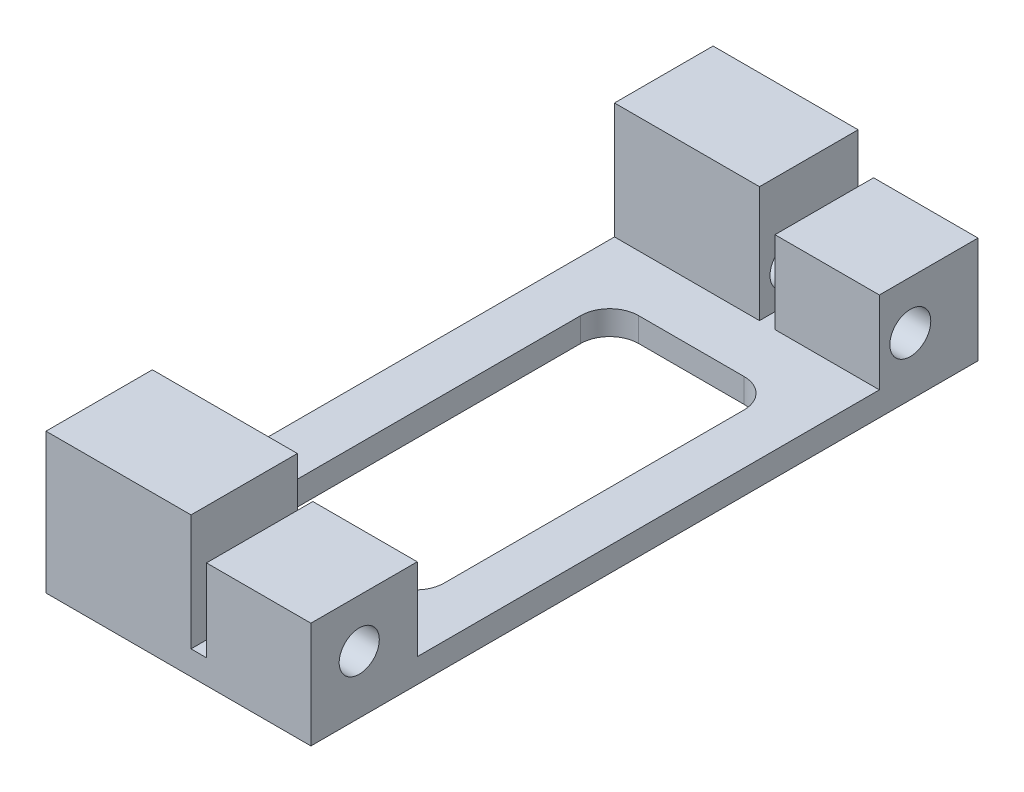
ISO-10303-21;
HEADER;
FILE_DESCRIPTION(('STEP AP214'),'2;1');
FILE_NAME('part.step','',(''),(''),'','','');
FILE_SCHEMA(('AUTOMOTIVE_DESIGN { 1 0 10303 214 1 1 1 1 }'));
ENDSEC;
DATA;
#1=APPLICATION_CONTEXT('core data for automotive mechanical design processes');
#2=APPLICATION_PROTOCOL_DEFINITION('international standard','automotive_design',2000,#1);
#3=PRODUCT_CONTEXT('',#1,'mechanical');
#4=PRODUCT('Part','Part','',(#3));
#5=PRODUCT_RELATED_PRODUCT_CATEGORY('part','',(#4));
#6=PRODUCT_DEFINITION_FORMATION('','',#4);
#7=PRODUCT_DEFINITION_CONTEXT('part definition',#1,'design');
#8=PRODUCT_DEFINITION('design','',#6,#7);
#9=PRODUCT_DEFINITION_SHAPE('','',#8);
#10=(LENGTH_UNIT() NAMED_UNIT(*) SI_UNIT(.MILLI.,.METRE.));
#11=(NAMED_UNIT(*) PLANE_ANGLE_UNIT() SI_UNIT($,.RADIAN.));
#12=(NAMED_UNIT(*) SI_UNIT($,.STERADIAN.) SOLID_ANGLE_UNIT());
#13=UNCERTAINTY_MEASURE_WITH_UNIT(LENGTH_MEASURE(1.E-05),#10,'distance_accuracy_value','');
#14=(GEOMETRIC_REPRESENTATION_CONTEXT(3) GLOBAL_UNCERTAINTY_ASSIGNED_CONTEXT((#13)) GLOBAL_UNIT_ASSIGNED_CONTEXT((#10,
#11,#12)) REPRESENTATION_CONTEXT('',''));
#15=CARTESIAN_POINT('',(0.,0.,0.));
#16=DIRECTION('',(0.,0.,1.));
#17=DIRECTION('',(1.,0.,0.));
#18=AXIS2_PLACEMENT_3D('',#15,#16,#17);
#19=CARTESIAN_POINT('',(0.,0.,0.));
#20=DIRECTION('',(0.,-1.,0.));
#21=DIRECTION('',(0.,0.,-1.));
#22=AXIS2_PLACEMENT_3D('',#19,#20,#21);
#23=PLANE('',#22);
#24=DIRECTION('',(0.,0.,1.));
#25=VECTOR('',#24,1.);
#26=CARTESIAN_POINT('',(-2.19999999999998,0.,-16.5));
#27=LINE('',#26,#25);
#28=CARTESIAN_POINT('',(-2.19999999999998,0.,-16.5));
#29=VERTEX_POINT('',#28);
#30=CARTESIAN_POINT('',(-2.19999999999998,0.,14.5));
#31=VERTEX_POINT('',#30);
#32=EDGE_CURVE('E331',#29,#31,#27,.T.);
#33=ORIENTED_EDGE('',*,*,#32,.F.);
#34=CARTESIAN_POINT('',(0.800000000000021,0.,-16.5));
#35=DIRECTION('',(0.,1.,0.));
#36=DIRECTION('',(0.,0.,1.));
#37=AXIS2_PLACEMENT_3D('',#34,#35,#36);
#38=CIRCLE('',#37,3.);
#39=CARTESIAN_POINT('',(0.800000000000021,0.,-19.5));
#40=VERTEX_POINT('',#39);
#41=EDGE_CURVE('E303',#40,#29,#38,.T.);
#42=ORIENTED_EDGE('',*,*,#41,.F.);
#43=DIRECTION('',(-1.,0.,0.));
#44=VECTOR('',#43,1.);
#45=CARTESIAN_POINT('',(0.800000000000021,0.,-19.5));
#46=LINE('',#45,#44);
#47=CARTESIAN_POINT('',(11.7,0.,-19.5));
#48=VERTEX_POINT('',#47);
#49=EDGE_CURVE('E308',#48,#40,#46,.T.);
#50=ORIENTED_EDGE('',*,*,#49,.F.);
#51=CARTESIAN_POINT('',(11.7,0.,-16.5));
#52=DIRECTION('',(0.,1.,0.));
#53=DIRECTION('',(0.,0.,-1.));
#54=AXIS2_PLACEMENT_3D('',#51,#52,#53);
#55=CIRCLE('',#54,3.);
#56=CARTESIAN_POINT('',(14.7,0.,-16.5));
#57=VERTEX_POINT('',#56);
#58=EDGE_CURVE('E346',#57,#48,#55,.T.);
#59=ORIENTED_EDGE('',*,*,#58,.F.);
#60=DIRECTION('',(0.,0.,-1.));
#61=VECTOR('',#60,1.);
#62=CARTESIAN_POINT('',(14.7,0.,-16.5));
#63=LINE('',#62,#61);
#64=CARTESIAN_POINT('',(14.7,0.,14.5));
#65=VERTEX_POINT('',#64);
#66=EDGE_CURVE('E343',#65,#57,#63,.T.);
#67=ORIENTED_EDGE('',*,*,#66,.F.);
#68=CARTESIAN_POINT('',(11.7,0.,14.5));
#69=DIRECTION('',(0.,1.,0.));
#70=DIRECTION('',(0.,0.,1.));
#71=AXIS2_PLACEMENT_3D('',#68,#69,#70);
#72=CIRCLE('',#71,3.);
#73=CARTESIAN_POINT('',(11.7,0.,17.5));
#74=VERTEX_POINT('',#73);
#75=EDGE_CURVE('E340',#74,#65,#72,.T.);
#76=ORIENTED_EDGE('',*,*,#75,.F.);
#77=DIRECTION('',(1.,0.,0.));
#78=VECTOR('',#77,1.);
#79=CARTESIAN_POINT('',(0.800000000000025,0.,17.5));
#80=LINE('',#79,#78);
#81=CARTESIAN_POINT('',(0.800000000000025,0.,17.5));
#82=VERTEX_POINT('',#81);
#83=EDGE_CURVE('E337',#82,#74,#80,.T.);
#84=ORIENTED_EDGE('',*,*,#83,.F.);
#85=CARTESIAN_POINT('',(0.800000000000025,0.,14.5));
#86=DIRECTION('',(0.,1.,0.));
#87=DIRECTION('',(0.,0.,1.));
#88=AXIS2_PLACEMENT_3D('',#85,#86,#87);
#89=CIRCLE('',#88,3.);
#90=EDGE_CURVE('E334',#31,#82,#89,.T.);
#91=ORIENTED_EDGE('',*,*,#90,.F.);
#92=EDGE_LOOP('',(#33,#42,#50,#59,#67,#76,#84,#91));
#93=FACE_BOUND('',#92,.T.);
#94=DIRECTION('',(-1.,0.,0.));
#95=VECTOR('',#94,1.);
#96=CARTESIAN_POINT('',(19.9,0.,22.5));
#97=LINE('',#96,#95);
#98=CARTESIAN_POINT('',(19.9,0.,22.5));
#99=VERTEX_POINT('',#98);
#100=CARTESIAN_POINT('',(9.10000000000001,0.,22.5));
#101=VERTEX_POINT('',#100);
#102=EDGE_CURVE('E59',#99,#101,#97,.T.);
#103=ORIENTED_EDGE('',*,*,#102,.F.);
#104=DIRECTION('',(0.,0.,-1.));
#105=VECTOR('',#104,1.);
#106=CARTESIAN_POINT('',(19.9,0.,-35.5));
#107=LINE('',#106,#105);
#108=CARTESIAN_POINT('',(19.9,0.,-25.3));
#109=VERTEX_POINT('',#108);
#110=EDGE_CURVE('E385',#99,#109,#107,.T.);
#111=ORIENTED_EDGE('',*,*,#110,.T.);
#112=DIRECTION('',(1.,0.,0.));
#113=VECTOR('',#112,1.);
#114=CARTESIAN_POINT('',(9.1,0.,-25.3));
#115=LINE('',#114,#113);
#116=CARTESIAN_POINT('',(9.1,0.,-25.3));
#117=VERTEX_POINT('',#116);
#118=EDGE_CURVE('E222',#117,#109,#115,.T.);
#119=ORIENTED_EDGE('',*,*,#118,.F.);
#120=DIRECTION('',(0.,0.,1.));
#121=VECTOR('',#120,1.);
#122=CARTESIAN_POINT('',(9.1,0.,-35.5));
#123=LINE('',#122,#121);
#124=CARTESIAN_POINT('',(9.1,0.,-35.5));
#125=VERTEX_POINT('',#124);
#126=EDGE_CURVE('E219',#125,#117,#123,.T.);
#127=ORIENTED_EDGE('',*,*,#126,.F.);
#128=DIRECTION('',(-1.,0.,0.));
#129=VECTOR('',#128,1.);
#130=CARTESIAN_POINT('',(19.9,0.,-35.5));
#131=LINE('',#130,#129);
#132=CARTESIAN_POINT('',(7.5,0.,-35.5));
#133=VERTEX_POINT('',#132);
#134=EDGE_CURVE('E372',#125,#133,#131,.T.);
#135=ORIENTED_EDGE('',*,*,#134,.T.);
#136=DIRECTION('',(0.,0.,-1.));
#137=VECTOR('',#136,1.);
#138=CARTESIAN_POINT('',(7.5,0.,-35.5));
#139=LINE('',#138,#137);
#140=CARTESIAN_POINT('',(7.5,0.,-25.3));
#141=VERTEX_POINT('',#140);
#142=EDGE_CURVE('E276',#141,#133,#139,.T.);
#143=ORIENTED_EDGE('',*,*,#142,.F.);
#144=DIRECTION('',(1.,0.,0.));
#145=VECTOR('',#144,1.);
#146=CARTESIAN_POINT('',(-7.5,0.,-25.3));
#147=LINE('',#146,#145);
#148=CARTESIAN_POINT('',(-7.5,0.,-25.3));
#149=VERTEX_POINT('',#148);
#150=EDGE_CURVE('E273',#149,#141,#147,.T.);
#151=ORIENTED_EDGE('',*,*,#150,.F.);
#152=DIRECTION('',(0.,0.,1.));
#153=VECTOR('',#152,1.);
#154=CARTESIAN_POINT('',(-7.5,0.,-35.5));
#155=LINE('',#154,#153);
#156=CARTESIAN_POINT('',(-7.49999999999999,0.,22.5));
#157=VERTEX_POINT('',#156);
#158=EDGE_CURVE('E353',#149,#157,#155,.T.);
#159=ORIENTED_EDGE('',*,*,#158,.T.);
#160=DIRECTION('',(-1.,0.,0.));
#161=VECTOR('',#160,1.);
#162=CARTESIAN_POINT('',(-7.5,0.,22.5));
#163=LINE('',#162,#161);
#164=CARTESIAN_POINT('',(7.5,0.,22.5));
#165=VERTEX_POINT('',#164);
#166=EDGE_CURVE('E291',#165,#157,#163,.T.);
#167=ORIENTED_EDGE('',*,*,#166,.F.);
#168=DIRECTION('',(0.,0.,-1.));
#169=VECTOR('',#168,1.);
#170=CARTESIAN_POINT('',(7.5,0.,22.5));
#171=LINE('',#170,#169);
#172=CARTESIAN_POINT('',(7.5,0.,33.5));
#173=VERTEX_POINT('',#172);
#174=EDGE_CURVE('E288',#173,#165,#171,.T.);
#175=ORIENTED_EDGE('',*,*,#174,.F.);
#176=DIRECTION('',(1.,0.,0.));
#177=VECTOR('',#176,1.);
#178=CARTESIAN_POINT('',(19.9,0.,33.5));
#179=LINE('',#178,#177);
#180=CARTESIAN_POINT('',(9.10000000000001,0.,33.5));
#181=VERTEX_POINT('',#180);
#182=EDGE_CURVE('E383',#173,#181,#179,.T.);
#183=ORIENTED_EDGE('',*,*,#182,.T.);
#184=DIRECTION('',(0.,0.,1.));
#185=VECTOR('',#184,1.);
#186=CARTESIAN_POINT('',(9.10000000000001,0.,22.5));
#187=LINE('',#186,#185);
#188=EDGE_CURVE('E54',#101,#181,#187,.T.);
#189=ORIENTED_EDGE('',*,*,#188,.F.);
#190=EDGE_LOOP('',(#103,#111,#119,#127,#135,#143,#151,#159,#167,#175,#183,#189));
#191=FACE_BOUND('',#190,.T.);
#192=ADVANCED_FACE('F37',(#93,#191),#23,.F.);
#193=CARTESIAN_POINT('',(-7.5,-2.5,-35.5));
#194=DIRECTION('',(-1.,0.,0.));
#195=DIRECTION('',(0.,0.,1.));
#196=AXIS2_PLACEMENT_3D('',#193,#194,#195);
#197=PLANE('',#196);
#198=CARTESIAN_POINT('',(-7.49999999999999,3.5,28.5));
#199=DIRECTION('',(-1.,0.,0.));
#200=DIRECTION('',(0.,0.,1.));
#201=AXIS2_PLACEMENT_3D('',#198,#199,#200);
#202=CIRCLE('',#201,2.07435792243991);
#203=CARTESIAN_POINT('',(-7.49999999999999,3.5,30.5743579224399));
#204=VERTEX_POINT('',#203);
#205=EDGE_CURVE('E398',#204,#204,#202,.T.);
#206=ORIENTED_EDGE('',*,*,#205,.F.);
#207=EDGE_LOOP('',(#206));
#208=FACE_BOUND('',#207,.T.);
#209=CARTESIAN_POINT('',(-7.5,3.5,-28.5));
#210=DIRECTION('',(-1.,0.,0.));
#211=DIRECTION('',(0.,0.,1.));
#212=AXIS2_PLACEMENT_3D('',#209,#210,#211);
#213=CIRCLE('',#212,2.11605772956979);
#214=CARTESIAN_POINT('',(-7.5,3.5,-26.3839422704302));
#215=VERTEX_POINT('',#214);
#216=EDGE_CURVE('E413',#215,#215,#213,.T.);
#217=ORIENTED_EDGE('',*,*,#216,.F.);
#218=EDGE_LOOP('',(#217));
#219=FACE_BOUND('',#218,.T.);
#220=DIRECTION('',(0.,0.,1.));
#221=VECTOR('',#220,1.);
#222=CARTESIAN_POINT('',(-7.5,12.,-35.5));
#223=LINE('',#222,#221);
#224=CARTESIAN_POINT('',(-7.5,12.,-35.5));
#225=VERTEX_POINT('',#224);
#226=CARTESIAN_POINT('',(-7.5,12.,-25.3));
#227=VERTEX_POINT('',#226);
#228=EDGE_CURVE('E249',#225,#227,#223,.T.);
#229=ORIENTED_EDGE('',*,*,#228,.F.);
#230=DIRECTION('',(0.,1.,0.));
#231=VECTOR('',#230,1.);
#232=CARTESIAN_POINT('',(-7.5,-2.5,-35.5));
#233=LINE('',#232,#231);
#234=CARTESIAN_POINT('',(-7.5,-2.5,-35.5));
#235=VERTEX_POINT('',#234);
#236=EDGE_CURVE('E11',#235,#225,#233,.T.);
#237=ORIENTED_EDGE('',*,*,#236,.F.);
#238=DIRECTION('',(0.,0.,1.));
#239=VECTOR('',#238,1.);
#240=CARTESIAN_POINT('',(-7.5,-2.5,-35.5));
#241=LINE('',#240,#239);
#242=CARTESIAN_POINT('',(-7.49999999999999,-2.5,33.5));
#243=VERTEX_POINT('',#242);
#244=EDGE_CURVE('E368',#235,#243,#241,.T.);
#245=ORIENTED_EDGE('',*,*,#244,.T.);
#246=DIRECTION('',(0.,1.,0.));
#247=VECTOR('',#246,1.);
#248=CARTESIAN_POINT('',(-7.49999999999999,-2.5,33.5));
#249=LINE('',#248,#247);
#250=CARTESIAN_POINT('',(-7.5,12.,33.5));
#251=VERTEX_POINT('',#250);
#252=EDGE_CURVE('E381',#243,#251,#249,.T.);
#253=ORIENTED_EDGE('',*,*,#252,.T.);
#254=DIRECTION('',(0.,0.,1.));
#255=VECTOR('',#254,1.);
#256=CARTESIAN_POINT('',(-7.5,12.,22.5));
#257=LINE('',#256,#255);
#258=CARTESIAN_POINT('',(-7.5,12.,22.5));
#259=VERTEX_POINT('',#258);
#260=EDGE_CURVE('E261',#259,#251,#257,.T.);
#261=ORIENTED_EDGE('',*,*,#260,.F.);
#262=DIRECTION('',(0.,-1.,0.));
#263=VECTOR('',#262,1.);
#264=CARTESIAN_POINT('',(-7.5,11.,22.5));
#265=LINE('',#264,#263);
#266=EDGE_CURVE('E294',#259,#157,#265,.T.);
#267=ORIENTED_EDGE('',*,*,#266,.T.);
#268=ORIENTED_EDGE('',*,*,#158,.F.);
#269=DIRECTION('',(0.,-1.,0.));
#270=VECTOR('',#269,1.);
#271=CARTESIAN_POINT('',(-7.5,11.,-25.3));
#272=LINE('',#271,#270);
#273=EDGE_CURVE('E285',#227,#149,#272,.T.);
#274=ORIENTED_EDGE('',*,*,#273,.F.);
#275=EDGE_LOOP('',(#229,#237,#245,#253,#261,#267,#268,#274));
#276=FACE_BOUND('',#275,.T.);
#277=ADVANCED_FACE('F39',(#208,#219,#276),#197,.T.);
#278=CARTESIAN_POINT('',(19.9,-2.5,-35.5));
#279=DIRECTION('',(0.,0.,-1.));
#280=DIRECTION('',(-1.,0.,0.));
#281=AXIS2_PLACEMENT_3D('',#278,#279,#280);
#282=PLANE('',#281);
#283=DIRECTION('',(0.,-1.,0.));
#284=VECTOR('',#283,1.);
#285=CARTESIAN_POINT('',(7.5,11.,-35.5));
#286=LINE('',#285,#284);
#287=CARTESIAN_POINT('',(7.5,12.,-35.5));
#288=VERTEX_POINT('',#287);
#289=EDGE_CURVE('E279',#288,#133,#286,.T.);
#290=ORIENTED_EDGE('',*,*,#289,.T.);
#291=ORIENTED_EDGE('',*,*,#134,.F.);
#292=DIRECTION('',(0.,-1.,0.));
#293=VECTOR('',#292,1.);
#294=CARTESIAN_POINT('',(9.1,8.5,-35.5));
#295=LINE('',#294,#293);
#296=CARTESIAN_POINT('',(9.1,8.5,-35.5));
#297=VERTEX_POINT('',#296);
#298=EDGE_CURVE('E246',#297,#125,#295,.T.);
#299=ORIENTED_EDGE('',*,*,#298,.F.);
#300=DIRECTION('',(-1.,0.,0.));
#301=VECTOR('',#300,1.);
#302=CARTESIAN_POINT('',(19.9,8.5,-35.5));
#303=LINE('',#302,#301);
#304=CARTESIAN_POINT('',(19.9,8.5,-35.5));
#305=VERTEX_POINT('',#304);
#306=EDGE_CURVE('E228',#305,#297,#303,.T.);
#307=ORIENTED_EDGE('',*,*,#306,.F.);
#308=DIRECTION('',(0.,1.,0.));
#309=VECTOR('',#308,1.);
#310=CARTESIAN_POINT('',(19.9,-2.5,-35.5));
#311=LINE('',#310,#309);
#312=CARTESIAN_POINT('',(19.9,-2.5,-35.5));
#313=VERTEX_POINT('',#312);
#314=EDGE_CURVE('E46',#313,#305,#311,.T.);
#315=ORIENTED_EDGE('',*,*,#314,.F.);
#316=DIRECTION('',(-1.,0.,0.));
#317=VECTOR('',#316,1.);
#318=CARTESIAN_POINT('',(19.9,-2.5,-35.5));
#319=LINE('',#318,#317);
#320=EDGE_CURVE('E378',#313,#235,#319,.T.);
#321=ORIENTED_EDGE('',*,*,#320,.T.);
#322=ORIENTED_EDGE('',*,*,#236,.T.);
#323=DIRECTION('',(-1.,0.,0.));
#324=VECTOR('',#323,1.);
#325=CARTESIAN_POINT('',(-7.5,12.,-35.5));
#326=LINE('',#325,#324);
#327=EDGE_CURVE('E258',#288,#225,#326,.T.);
#328=ORIENTED_EDGE('',*,*,#327,.F.);
#329=EDGE_LOOP('',(#290,#291,#299,#307,#315,#321,#322,#328));
#330=FACE_BOUND('',#329,.T.);
#331=ADVANCED_FACE('F432',(#330),#282,.T.);
#332=CARTESIAN_POINT('',(19.9,-2.5,-35.5));
#333=DIRECTION('',(1.,0.,0.));
#334=DIRECTION('',(0.,0.,-1.));
#335=AXIS2_PLACEMENT_3D('',#332,#333,#334);
#336=PLANE('',#335);
#337=CARTESIAN_POINT('',(19.9,3.5,28.5));
#338=DIRECTION('',(1.,0.,0.));
#339=DIRECTION('',(0.,0.,-1.));
#340=AXIS2_PLACEMENT_3D('',#337,#338,#339);
#341=CIRCLE('',#340,2.07435792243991);
#342=CARTESIAN_POINT('',(19.9,3.5,26.4256420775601));
#343=VERTEX_POINT('',#342);
#344=EDGE_CURVE('E394',#343,#343,#341,.T.);
#345=ORIENTED_EDGE('',*,*,#344,.F.);
#346=EDGE_LOOP('',(#345));
#347=FACE_BOUND('',#346,.T.);
#348=CARTESIAN_POINT('',(19.9,3.5,-28.5));
#349=DIRECTION('',(1.,0.,0.));
#350=DIRECTION('',(0.,0.,-1.));
#351=AXIS2_PLACEMENT_3D('',#348,#349,#350);
#352=CIRCLE('',#351,2.11605772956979);
#353=CARTESIAN_POINT('',(19.9,3.5,-30.6160577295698));
#354=VERTEX_POINT('',#353);
#355=EDGE_CURVE('E401',#354,#354,#352,.T.);
#356=ORIENTED_EDGE('',*,*,#355,.F.);
#357=EDGE_LOOP('',(#356));
#358=FACE_BOUND('',#357,.T.);
#359=ORIENTED_EDGE('',*,*,#110,.F.);
#360=DIRECTION('',(0.,-1.,0.));
#361=VECTOR('',#360,1.);
#362=CARTESIAN_POINT('',(19.9,8.5,22.5));
#363=LINE('',#362,#361);
#364=CARTESIAN_POINT('',(19.9,8.5,22.5));
#365=VERTEX_POINT('',#364);
#366=EDGE_CURVE('E224',#365,#99,#363,.T.);
#367=ORIENTED_EDGE('',*,*,#366,.F.);
#368=DIRECTION('',(0.,0.,-1.));
#369=VECTOR('',#368,1.);
#370=CARTESIAN_POINT('',(19.9,8.5,33.5));
#371=LINE('',#370,#369);
#372=CARTESIAN_POINT('',(19.9,8.5,33.5));
#373=VERTEX_POINT('',#372);
#374=EDGE_CURVE('E213',#373,#365,#371,.T.);
#375=ORIENTED_EDGE('',*,*,#374,.F.);
#376=DIRECTION('',(0.,1.,0.));
#377=VECTOR('',#376,1.);
#378=CARTESIAN_POINT('',(19.9,-2.5,33.5));
#379=LINE('',#378,#377);
#380=CARTESIAN_POINT('',(19.9,-2.5,33.5));
#381=VERTEX_POINT('',#380);
#382=EDGE_CURVE('E389',#381,#373,#379,.T.);
#383=ORIENTED_EDGE('',*,*,#382,.F.);
#384=DIRECTION('',(0.,0.,-1.));
#385=VECTOR('',#384,1.);
#386=CARTESIAN_POINT('',(19.9,-2.5,-35.5));
#387=LINE('',#386,#385);
#388=EDGE_CURVE('E375',#381,#313,#387,.T.);
#389=ORIENTED_EDGE('',*,*,#388,.T.);
#390=ORIENTED_EDGE('',*,*,#314,.T.);
#391=DIRECTION('',(0.,0.,-1.));
#392=VECTOR('',#391,1.);
#393=CARTESIAN_POINT('',(19.9,8.5,-25.3));
#394=LINE('',#393,#392);
#395=CARTESIAN_POINT('',(19.9,8.5,-25.3));
#396=VERTEX_POINT('',#395);
#397=EDGE_CURVE('E235',#396,#305,#394,.T.);
#398=ORIENTED_EDGE('',*,*,#397,.F.);
#399=DIRECTION('',(0.,-1.,0.));
#400=VECTOR('',#399,1.);
#401=CARTESIAN_POINT('',(19.9,8.5,-25.3));
#402=LINE('',#401,#400);
#403=EDGE_CURVE('E237',#396,#109,#402,.T.);
#404=ORIENTED_EDGE('',*,*,#403,.T.);
#405=EDGE_LOOP('',(#359,#367,#375,#383,#389,#390,#398,#404));
#406=FACE_BOUND('',#405,.T.);
#407=ADVANCED_FACE('F420',(#347,#358,#406),#336,.T.);
#408=CARTESIAN_POINT('',(19.9,-2.5,33.5));
#409=DIRECTION('',(0.,0.,1.));
#410=DIRECTION('',(1.,0.,0.));
#411=AXIS2_PLACEMENT_3D('',#408,#409,#410);
#412=PLANE('',#411);
#413=DIRECTION('',(1.,0.,0.));
#414=VECTOR('',#413,1.);
#415=CARTESIAN_POINT('',(-7.5,12.,33.5));
#416=LINE('',#415,#414);
#417=CARTESIAN_POINT('',(7.5,12.,33.5));
#418=VERTEX_POINT('',#417);
#419=EDGE_CURVE('E264',#251,#418,#416,.T.);
#420=ORIENTED_EDGE('',*,*,#419,.F.);
#421=ORIENTED_EDGE('',*,*,#252,.F.);
#422=DIRECTION('',(1.,0.,0.));
#423=VECTOR('',#422,1.);
#424=CARTESIAN_POINT('',(19.9,-2.5,33.5));
#425=LINE('',#424,#423);
#426=EDGE_CURVE('E371',#243,#381,#425,.T.);
#427=ORIENTED_EDGE('',*,*,#426,.T.);
#428=ORIENTED_EDGE('',*,*,#382,.T.);
#429=DIRECTION('',(1.,0.,0.));
#430=VECTOR('',#429,1.);
#431=CARTESIAN_POINT('',(9.10000000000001,8.5,33.5));
#432=LINE('',#431,#430);
#433=CARTESIAN_POINT('',(9.10000000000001,8.5,33.5));
#434=VERTEX_POINT('',#433);
#435=EDGE_CURVE('E207',#434,#373,#432,.T.);
#436=ORIENTED_EDGE('',*,*,#435,.F.);
#437=DIRECTION('',(0.,-1.,0.));
#438=VECTOR('',#437,1.);
#439=CARTESIAN_POINT('',(9.10000000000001,8.5,33.5));
#440=LINE('',#439,#438);
#441=EDGE_CURVE('E203',#434,#181,#440,.T.);
#442=ORIENTED_EDGE('',*,*,#441,.T.);
#443=ORIENTED_EDGE('',*,*,#182,.F.);
#444=DIRECTION('',(0.,-1.,0.));
#445=VECTOR('',#444,1.);
#446=CARTESIAN_POINT('',(7.5,11.,33.5));
#447=LINE('',#446,#445);
#448=EDGE_CURVE('E300',#418,#173,#447,.T.);
#449=ORIENTED_EDGE('',*,*,#448,.F.);
#450=EDGE_LOOP('',(#420,#421,#427,#428,#436,#442,#443,#449));
#451=FACE_BOUND('',#450,.T.);
#452=ADVANCED_FACE('F458',(#451),#412,.T.);
#453=CARTESIAN_POINT('',(0.,-2.5,0.));
#454=DIRECTION('',(0.,-1.,0.));
#455=DIRECTION('',(0.,0.,-1.));
#456=AXIS2_PLACEMENT_3D('',#453,#454,#455);
#457=PLANE('',#456);
#458=CARTESIAN_POINT('',(0.800000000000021,-2.5,-16.5));
#459=DIRECTION('',(0.,1.,0.));
#460=DIRECTION('',(0.,0.,1.));
#461=AXIS2_PLACEMENT_3D('',#458,#459,#460);
#462=CIRCLE('',#461,3.);
#463=CARTESIAN_POINT('',(0.800000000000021,-2.5,-19.5));
#464=VERTEX_POINT('',#463);
#465=CARTESIAN_POINT('',(-2.19999999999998,-2.5,-16.5));
#466=VERTEX_POINT('',#465);
#467=EDGE_CURVE('E304',#464,#466,#462,.T.);
#468=ORIENTED_EDGE('',*,*,#467,.T.);
#469=DIRECTION('',(0.,0.,1.));
#470=VECTOR('',#469,1.);
#471=CARTESIAN_POINT('',(-2.19999999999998,-2.5,-16.5));
#472=LINE('',#471,#470);
#473=CARTESIAN_POINT('',(-2.19999999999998,-2.5,14.5));
#474=VERTEX_POINT('',#473);
#475=EDGE_CURVE('E307',#466,#474,#472,.T.);
#476=ORIENTED_EDGE('',*,*,#475,.T.);
#477=CARTESIAN_POINT('',(0.800000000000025,-2.5,14.5));
#478=DIRECTION('',(0.,1.,0.));
#479=DIRECTION('',(0.,0.,1.));
#480=AXIS2_PLACEMENT_3D('',#477,#478,#479);
#481=CIRCLE('',#480,3.);
#482=CARTESIAN_POINT('',(0.800000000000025,-2.5,17.5));
#483=VERTEX_POINT('',#482);
#484=EDGE_CURVE('E311',#474,#483,#481,.T.);
#485=ORIENTED_EDGE('',*,*,#484,.T.);
#486=DIRECTION('',(1.,0.,0.));
#487=VECTOR('',#486,1.);
#488=CARTESIAN_POINT('',(0.800000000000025,-2.5,17.5));
#489=LINE('',#488,#487);
#490=CARTESIAN_POINT('',(11.7,-2.5,17.5));
#491=VERTEX_POINT('',#490);
#492=EDGE_CURVE('E314',#483,#491,#489,.T.);
#493=ORIENTED_EDGE('',*,*,#492,.T.);
#494=CARTESIAN_POINT('',(11.7,-2.5,14.5));
#495=DIRECTION('',(0.,1.,0.));
#496=DIRECTION('',(0.,0.,1.));
#497=AXIS2_PLACEMENT_3D('',#494,#495,#496);
#498=CIRCLE('',#497,3.);
#499=CARTESIAN_POINT('',(14.7,-2.5,14.5));
#500=VERTEX_POINT('',#499);
#501=EDGE_CURVE('E317',#491,#500,#498,.T.);
#502=ORIENTED_EDGE('',*,*,#501,.T.);
#503=DIRECTION('',(0.,0.,-1.));
#504=VECTOR('',#503,1.);
#505=CARTESIAN_POINT('',(14.7,-2.5,-16.5));
#506=LINE('',#505,#504);
#507=CARTESIAN_POINT('',(14.7,-2.5,-16.5));
#508=VERTEX_POINT('',#507);
#509=EDGE_CURVE('E320',#500,#508,#506,.T.);
#510=ORIENTED_EDGE('',*,*,#509,.T.);
#511=CARTESIAN_POINT('',(11.7,-2.5,-16.5));
#512=DIRECTION('',(0.,1.,0.));
#513=DIRECTION('',(0.,0.,-1.));
#514=AXIS2_PLACEMENT_3D('',#511,#512,#513);
#515=CIRCLE('',#514,3.);
#516=CARTESIAN_POINT('',(11.7,-2.5,-19.5));
#517=VERTEX_POINT('',#516);
#518=EDGE_CURVE('E323',#508,#517,#515,.T.);
#519=ORIENTED_EDGE('',*,*,#518,.T.);
#520=DIRECTION('',(-1.,0.,0.));
#521=VECTOR('',#520,1.);
#522=CARTESIAN_POINT('',(0.800000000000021,-2.5,-19.5));
#523=LINE('',#522,#521);
#524=EDGE_CURVE('E326',#517,#464,#523,.T.);
#525=ORIENTED_EDGE('',*,*,#524,.T.);
#526=EDGE_LOOP('',(#468,#476,#485,#493,#502,#510,#519,#525));
#527=FACE_BOUND('',#526,.T.);
#528=ORIENTED_EDGE('',*,*,#244,.F.);
#529=ORIENTED_EDGE('',*,*,#320,.F.);
#530=ORIENTED_EDGE('',*,*,#388,.F.);
#531=ORIENTED_EDGE('',*,*,#426,.F.);
#532=EDGE_LOOP('',(#528,#529,#530,#531));
#533=FACE_BOUND('',#532,.T.);
#534=ADVANCED_FACE('F464',(#527,#533),#457,.T.);
#535=CARTESIAN_POINT('',(0.800000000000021,-2.5,-16.5));
#536=DIRECTION('',(0.,1.,0.));
#537=DIRECTION('',(0.,0.,1.));
#538=AXIS2_PLACEMENT_3D('',#535,#536,#537);
#539=CYLINDRICAL_SURFACE('',#538,3.);
#540=ORIENTED_EDGE('',*,*,#41,.T.);
#541=DIRECTION('',(0.,1.,0.));
#542=VECTOR('',#541,1.);
#543=CARTESIAN_POINT('',(-2.19999999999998,-2.5,-16.5));
#544=LINE('',#543,#542);
#545=EDGE_CURVE('E329',#466,#29,#544,.T.);
#546=ORIENTED_EDGE('',*,*,#545,.F.);
#547=ORIENTED_EDGE('',*,*,#467,.F.);
#548=DIRECTION('',(0.,1.,0.));
#549=VECTOR('',#548,1.);
#550=CARTESIAN_POINT('',(0.800000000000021,-2.5,-19.5));
#551=LINE('',#550,#549);
#552=EDGE_CURVE('E351',#464,#40,#551,.T.);
#553=ORIENTED_EDGE('',*,*,#552,.T.);
#554=EDGE_LOOP('',(#540,#546,#547,#553));
#555=FACE_BOUND('',#554,.T.);
#556=ADVANCED_FACE('F494',(#555),#539,.F.);
#557=CARTESIAN_POINT('',(0.800000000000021,-2.5,-19.5));
#558=DIRECTION('',(0.,0.,-1.));
#559=DIRECTION('',(-1.,0.,0.));
#560=AXIS2_PLACEMENT_3D('',#557,#558,#559);
#561=PLANE('',#560);
#562=ORIENTED_EDGE('',*,*,#49,.T.);
#563=ORIENTED_EDGE('',*,*,#552,.F.);
#564=ORIENTED_EDGE('',*,*,#524,.F.);
#565=DIRECTION('',(0.,1.,0.));
#566=VECTOR('',#565,1.);
#567=CARTESIAN_POINT('',(11.7,-2.5,-19.5));
#568=LINE('',#567,#566);
#569=EDGE_CURVE('E354',#517,#48,#568,.T.);
#570=ORIENTED_EDGE('',*,*,#569,.T.);
#571=EDGE_LOOP('',(#562,#563,#564,#570));
#572=FACE_BOUND('',#571,.T.);
#573=ADVANCED_FACE('F499',(#572),#561,.F.);
#574=CARTESIAN_POINT('',(11.7,-2.5,-16.5));
#575=DIRECTION('',(0.,1.,0.));
#576=DIRECTION('',(0.,0.,1.));
#577=AXIS2_PLACEMENT_3D('',#574,#575,#576);
#578=CYLINDRICAL_SURFACE('',#577,3.);
#579=ORIENTED_EDGE('',*,*,#58,.T.);
#580=ORIENTED_EDGE('',*,*,#569,.F.);
#581=ORIENTED_EDGE('',*,*,#518,.F.);
#582=DIRECTION('',(0.,1.,0.));
#583=VECTOR('',#582,1.);
#584=CARTESIAN_POINT('',(14.7,-2.5,-16.5));
#585=LINE('',#584,#583);
#586=EDGE_CURVE('E356',#508,#57,#585,.T.);
#587=ORIENTED_EDGE('',*,*,#586,.T.);
#588=EDGE_LOOP('',(#579,#580,#581,#587));
#589=FACE_BOUND('',#588,.T.);
#590=ADVANCED_FACE('F525',(#589),#578,.F.);
#591=CARTESIAN_POINT('',(14.7,-2.5,-16.5));
#592=DIRECTION('',(1.,0.,0.));
#593=DIRECTION('',(0.,0.,-1.));
#594=AXIS2_PLACEMENT_3D('',#591,#592,#593);
#595=PLANE('',#594);
#596=ORIENTED_EDGE('',*,*,#66,.T.);
#597=ORIENTED_EDGE('',*,*,#586,.F.);
#598=ORIENTED_EDGE('',*,*,#509,.F.);
#599=DIRECTION('',(0.,1.,0.));
#600=VECTOR('',#599,1.);
#601=CARTESIAN_POINT('',(14.7,-2.5,14.5));
#602=LINE('',#601,#600);
#603=EDGE_CURVE('E358',#500,#65,#602,.T.);
#604=ORIENTED_EDGE('',*,*,#603,.T.);
#605=EDGE_LOOP('',(#596,#597,#598,#604));
#606=FACE_BOUND('',#605,.T.);
#607=ADVANCED_FACE('F522',(#606),#595,.F.);
#608=CARTESIAN_POINT('',(11.7,-2.5,14.5));
#609=DIRECTION('',(0.,1.,0.));
#610=DIRECTION('',(0.,0.,1.));
#611=AXIS2_PLACEMENT_3D('',#608,#609,#610);
#612=CYLINDRICAL_SURFACE('',#611,3.);
#613=ORIENTED_EDGE('',*,*,#75,.T.);
#614=ORIENTED_EDGE('',*,*,#603,.F.);
#615=ORIENTED_EDGE('',*,*,#501,.F.);
#616=DIRECTION('',(0.,1.,0.));
#617=VECTOR('',#616,1.);
#618=CARTESIAN_POINT('',(11.7,-2.5,17.5));
#619=LINE('',#618,#617);
#620=EDGE_CURVE('E360',#491,#74,#619,.T.);
#621=ORIENTED_EDGE('',*,*,#620,.T.);
#622=EDGE_LOOP('',(#613,#614,#615,#621));
#623=FACE_BOUND('',#622,.T.);
#624=ADVANCED_FACE('F518',(#623),#612,.F.);
#625=CARTESIAN_POINT('',(0.800000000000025,-2.5,17.5));
#626=DIRECTION('',(0.,0.,1.));
#627=DIRECTION('',(1.,0.,0.));
#628=AXIS2_PLACEMENT_3D('',#625,#626,#627);
#629=PLANE('',#628);
#630=ORIENTED_EDGE('',*,*,#83,.T.);
#631=ORIENTED_EDGE('',*,*,#620,.F.);
#632=ORIENTED_EDGE('',*,*,#492,.F.);
#633=DIRECTION('',(0.,1.,0.));
#634=VECTOR('',#633,1.);
#635=CARTESIAN_POINT('',(0.800000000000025,-2.5,17.5));
#636=LINE('',#635,#634);
#637=EDGE_CURVE('E362',#483,#82,#636,.T.);
#638=ORIENTED_EDGE('',*,*,#637,.T.);
#639=EDGE_LOOP('',(#630,#631,#632,#638));
#640=FACE_BOUND('',#639,.T.);
#641=ADVANCED_FACE('F515',(#640),#629,.F.);
#642=CARTESIAN_POINT('',(0.800000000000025,-2.5,14.5));
#643=DIRECTION('',(0.,1.,0.));
#644=DIRECTION('',(0.,0.,1.));
#645=AXIS2_PLACEMENT_3D('',#642,#643,#644);
#646=CYLINDRICAL_SURFACE('',#645,3.);
#647=ORIENTED_EDGE('',*,*,#90,.T.);
#648=ORIENTED_EDGE('',*,*,#637,.F.);
#649=ORIENTED_EDGE('',*,*,#484,.F.);
#650=DIRECTION('',(0.,1.,0.));
#651=VECTOR('',#650,1.);
#652=CARTESIAN_POINT('',(-2.19999999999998,-2.5,14.5));
#653=LINE('',#652,#651);
#654=EDGE_CURVE('E364',#474,#31,#653,.T.);
#655=ORIENTED_EDGE('',*,*,#654,.T.);
#656=EDGE_LOOP('',(#647,#648,#649,#655));
#657=FACE_BOUND('',#656,.T.);
#658=ADVANCED_FACE('F510',(#657),#646,.F.);
#659=CARTESIAN_POINT('',(-2.19999999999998,-2.5,-16.5));
#660=DIRECTION('',(-1.,0.,0.));
#661=DIRECTION('',(0.,0.,1.));
#662=AXIS2_PLACEMENT_3D('',#659,#660,#661);
#663=PLANE('',#662);
#664=ORIENTED_EDGE('',*,*,#32,.T.);
#665=ORIENTED_EDGE('',*,*,#654,.F.);
#666=ORIENTED_EDGE('',*,*,#475,.F.);
#667=ORIENTED_EDGE('',*,*,#545,.T.);
#668=EDGE_LOOP('',(#664,#665,#666,#667));
#669=FACE_BOUND('',#668,.T.);
#670=ADVANCED_FACE('F507',(#669),#663,.F.);
#671=CARTESIAN_POINT('',(7.5,11.,22.5));
#672=DIRECTION('',(-1.,0.,0.));
#673=DIRECTION('',(0.,0.,1.));
#674=AXIS2_PLACEMENT_3D('',#671,#672,#673);
#675=PLANE('',#674);
#676=CARTESIAN_POINT('',(7.5,3.5,28.5));
#677=DIRECTION('',(-1.,0.,0.));
#678=DIRECTION('',(0.,0.,1.));
#679=AXIS2_PLACEMENT_3D('',#676,#677,#678);
#680=CIRCLE('',#679,2.07435792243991);
#681=CARTESIAN_POINT('',(7.5,3.5,30.5743579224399));
#682=VERTEX_POINT('',#681);
#683=EDGE_CURVE('E393',#682,#682,#680,.T.);
#684=ORIENTED_EDGE('',*,*,#683,.T.);
#685=EDGE_LOOP('',(#684));
#686=FACE_BOUND('',#685,.T.);
#687=ORIENTED_EDGE('',*,*,#174,.T.);
#688=DIRECTION('',(0.,-1.,0.));
#689=VECTOR('',#688,1.);
#690=CARTESIAN_POINT('',(7.5,11.,22.5));
#691=LINE('',#690,#689);
#692=CARTESIAN_POINT('',(7.5,12.,22.5));
#693=VERTEX_POINT('',#692);
#694=EDGE_CURVE('E297',#693,#165,#691,.T.);
#695=ORIENTED_EDGE('',*,*,#694,.F.);
#696=DIRECTION('',(0.,0.,-1.));
#697=VECTOR('',#696,1.);
#698=CARTESIAN_POINT('',(7.5,12.,22.5));
#699=LINE('',#698,#697);
#700=EDGE_CURVE('E267',#418,#693,#699,.T.);
#701=ORIENTED_EDGE('',*,*,#700,.F.);
#702=ORIENTED_EDGE('',*,*,#448,.T.);
#703=EDGE_LOOP('',(#687,#695,#701,#702));
#704=FACE_BOUND('',#703,.T.);
#705=ADVANCED_FACE('F455',(#686,#704),#675,.F.);
#706=CARTESIAN_POINT('',(-7.5,11.,22.5));
#707=DIRECTION('',(0.,0.,1.));
#708=DIRECTION('',(1.,0.,0.));
#709=AXIS2_PLACEMENT_3D('',#706,#707,#708);
#710=PLANE('',#709);
#711=ORIENTED_EDGE('',*,*,#166,.T.);
#712=ORIENTED_EDGE('',*,*,#266,.F.);
#713=DIRECTION('',(-1.,0.,0.));
#714=VECTOR('',#713,1.);
#715=CARTESIAN_POINT('',(-7.5,12.,22.5));
#716=LINE('',#715,#714);
#717=EDGE_CURVE('E270',#693,#259,#716,.T.);
#718=ORIENTED_EDGE('',*,*,#717,.F.);
#719=ORIENTED_EDGE('',*,*,#694,.T.);
#720=EDGE_LOOP('',(#711,#712,#718,#719));
#721=FACE_BOUND('',#720,.T.);
#722=ADVANCED_FACE('F449',(#721),#710,.F.);
#723=CARTESIAN_POINT('',(-7.5,11.,-25.3));
#724=DIRECTION('',(0.,0.,-1.));
#725=DIRECTION('',(-1.,0.,0.));
#726=AXIS2_PLACEMENT_3D('',#723,#724,#725);
#727=PLANE('',#726);
#728=ORIENTED_EDGE('',*,*,#150,.T.);
#729=DIRECTION('',(0.,-1.,0.));
#730=VECTOR('',#729,1.);
#731=CARTESIAN_POINT('',(7.5,11.,-25.3));
#732=LINE('',#731,#730);
#733=CARTESIAN_POINT('',(7.5,12.,-25.3));
#734=VERTEX_POINT('',#733);
#735=EDGE_CURVE('E282',#734,#141,#732,.T.);
#736=ORIENTED_EDGE('',*,*,#735,.F.);
#737=DIRECTION('',(1.,0.,0.));
#738=VECTOR('',#737,1.);
#739=CARTESIAN_POINT('',(-7.5,12.,-25.3));
#740=LINE('',#739,#738);
#741=EDGE_CURVE('E252',#227,#734,#740,.T.);
#742=ORIENTED_EDGE('',*,*,#741,.F.);
#743=ORIENTED_EDGE('',*,*,#273,.T.);
#744=EDGE_LOOP('',(#728,#736,#742,#743));
#745=FACE_BOUND('',#744,.T.);
#746=ADVANCED_FACE('F443',(#745),#727,.F.);
#747=CARTESIAN_POINT('',(7.5,11.,-35.5));
#748=DIRECTION('',(-1.,0.,0.));
#749=DIRECTION('',(0.,0.,1.));
#750=AXIS2_PLACEMENT_3D('',#747,#748,#749);
#751=PLANE('',#750);
#752=CARTESIAN_POINT('',(7.5,3.5,-28.5));
#753=DIRECTION('',(-1.,0.,0.));
#754=DIRECTION('',(0.,0.,1.));
#755=AXIS2_PLACEMENT_3D('',#752,#753,#754);
#756=CIRCLE('',#755,2.11605772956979);
#757=CARTESIAN_POINT('',(7.5,3.5,-26.3839422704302));
#758=VERTEX_POINT('',#757);
#759=EDGE_CURVE('E410',#758,#758,#756,.T.);
#760=ORIENTED_EDGE('',*,*,#759,.T.);
#761=EDGE_LOOP('',(#760));
#762=FACE_BOUND('',#761,.T.);
#763=ORIENTED_EDGE('',*,*,#142,.T.);
#764=ORIENTED_EDGE('',*,*,#289,.F.);
#765=DIRECTION('',(0.,0.,-1.));
#766=VECTOR('',#765,1.);
#767=CARTESIAN_POINT('',(7.5,12.,-35.5));
#768=LINE('',#767,#766);
#769=EDGE_CURVE('E255',#734,#288,#768,.T.);
#770=ORIENTED_EDGE('',*,*,#769,.F.);
#771=ORIENTED_EDGE('',*,*,#735,.T.);
#772=EDGE_LOOP('',(#763,#764,#770,#771));
#773=FACE_BOUND('',#772,.T.);
#774=ADVANCED_FACE('F437',(#762,#773),#751,.F.);
#775=CARTESIAN_POINT('',(0.,12.,0.));
#776=DIRECTION('',(0.,1.,0.));
#777=DIRECTION('',(0.,0.,1.));
#778=AXIS2_PLACEMENT_3D('',#775,#776,#777);
#779=PLANE('',#778);
#780=ORIENTED_EDGE('',*,*,#260,.T.);
#781=ORIENTED_EDGE('',*,*,#419,.T.);
#782=ORIENTED_EDGE('',*,*,#700,.T.);
#783=ORIENTED_EDGE('',*,*,#717,.T.);
#784=EDGE_LOOP('',(#780,#781,#782,#783));
#785=FACE_BOUND('',#784,.T.);
#786=ADVANCED_FACE('F451',(#785),#779,.T.);
#787=CARTESIAN_POINT('',(0.,12.,0.));
#788=DIRECTION('',(0.,1.,0.));
#789=DIRECTION('',(0.,0.,1.));
#790=AXIS2_PLACEMENT_3D('',#787,#788,#789);
#791=PLANE('',#790);
#792=ORIENTED_EDGE('',*,*,#228,.T.);
#793=ORIENTED_EDGE('',*,*,#741,.T.);
#794=ORIENTED_EDGE('',*,*,#769,.T.);
#795=ORIENTED_EDGE('',*,*,#327,.T.);
#796=EDGE_LOOP('',(#792,#793,#794,#795));
#797=FACE_BOUND('',#796,.T.);
#798=ADVANCED_FACE('F439',(#797),#791,.T.);
#799=CARTESIAN_POINT('',(9.1,8.5,-35.5));
#800=DIRECTION('',(1.,0.,0.));
#801=DIRECTION('',(0.,0.,-1.));
#802=AXIS2_PLACEMENT_3D('',#799,#800,#801);
#803=PLANE('',#802);
#804=CARTESIAN_POINT('',(9.1,3.5,-28.5));
#805=DIRECTION('',(1.,0.,0.));
#806=DIRECTION('',(0.,0.,-1.));
#807=AXIS2_PLACEMENT_3D('',#804,#805,#806);
#808=CIRCLE('',#807,2.11605772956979);
#809=CARTESIAN_POINT('',(9.1,3.5,-30.6160577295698));
#810=VERTEX_POINT('',#809);
#811=EDGE_CURVE('E41',#810,#810,#808,.T.);
#812=ORIENTED_EDGE('',*,*,#811,.T.);
#813=EDGE_LOOP('',(#812));
#814=FACE_BOUND('',#813,.T.);
#815=ORIENTED_EDGE('',*,*,#126,.T.);
#816=DIRECTION('',(0.,-1.,0.));
#817=VECTOR('',#816,1.);
#818=CARTESIAN_POINT('',(9.1,8.5,-25.3));
#819=LINE('',#818,#817);
#820=CARTESIAN_POINT('',(9.1,8.5,-25.3));
#821=VERTEX_POINT('',#820);
#822=EDGE_CURVE('E243',#821,#117,#819,.T.);
#823=ORIENTED_EDGE('',*,*,#822,.F.);
#824=DIRECTION('',(0.,0.,1.));
#825=VECTOR('',#824,1.);
#826=CARTESIAN_POINT('',(9.1,8.5,-35.5));
#827=LINE('',#826,#825);
#828=EDGE_CURVE('E231',#297,#821,#827,.T.);
#829=ORIENTED_EDGE('',*,*,#828,.F.);
#830=ORIENTED_EDGE('',*,*,#298,.T.);
#831=EDGE_LOOP('',(#815,#823,#829,#830));
#832=FACE_BOUND('',#831,.T.);
#833=ADVANCED_FACE('F428',(#814,#832),#803,.F.);
#834=CARTESIAN_POINT('',(9.1,8.5,-25.3));
#835=DIRECTION('',(0.,0.,-1.));
#836=DIRECTION('',(-1.,0.,0.));
#837=AXIS2_PLACEMENT_3D('',#834,#835,#836);
#838=PLANE('',#837);
#839=ORIENTED_EDGE('',*,*,#118,.T.);
#840=ORIENTED_EDGE('',*,*,#403,.F.);
#841=DIRECTION('',(1.,0.,0.));
#842=VECTOR('',#841,1.);
#843=CARTESIAN_POINT('',(9.1,8.5,-25.3));
#844=LINE('',#843,#842);
#845=EDGE_CURVE('E233',#821,#396,#844,.T.);
#846=ORIENTED_EDGE('',*,*,#845,.F.);
#847=ORIENTED_EDGE('',*,*,#822,.T.);
#848=EDGE_LOOP('',(#839,#840,#846,#847));
#849=FACE_BOUND('',#848,.T.);
#850=ADVANCED_FACE('F424',(#849),#838,.F.);
#851=CARTESIAN_POINT('',(0.,8.5,0.));
#852=DIRECTION('',(0.,1.,0.));
#853=DIRECTION('',(0.,0.,1.));
#854=AXIS2_PLACEMENT_3D('',#851,#852,#853);
#855=PLANE('',#854);
#856=ORIENTED_EDGE('',*,*,#306,.T.);
#857=ORIENTED_EDGE('',*,*,#828,.T.);
#858=ORIENTED_EDGE('',*,*,#845,.T.);
#859=ORIENTED_EDGE('',*,*,#397,.T.);
#860=EDGE_LOOP('',(#856,#857,#858,#859));
#861=FACE_BOUND('',#860,.T.);
#862=ADVANCED_FACE('F466',(#861),#855,.T.);
#863=CARTESIAN_POINT('',(19.9,8.5,22.5));
#864=DIRECTION('',(0.,0.,1.));
#865=DIRECTION('',(1.,0.,0.));
#866=AXIS2_PLACEMENT_3D('',#863,#864,#865);
#867=PLANE('',#866);
#868=ORIENTED_EDGE('',*,*,#102,.T.);
#869=DIRECTION('',(0.,-1.,0.));
#870=VECTOR('',#869,1.);
#871=CARTESIAN_POINT('',(9.10000000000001,8.5,22.5));
#872=LINE('',#871,#870);
#873=CARTESIAN_POINT('',(9.10000000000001,8.5,22.5));
#874=VERTEX_POINT('',#873);
#875=EDGE_CURVE('E201',#874,#101,#872,.T.);
#876=ORIENTED_EDGE('',*,*,#875,.F.);
#877=DIRECTION('',(-1.,0.,0.));
#878=VECTOR('',#877,1.);
#879=CARTESIAN_POINT('',(19.9,8.5,22.5));
#880=LINE('',#879,#878);
#881=EDGE_CURVE('E208',#365,#874,#880,.T.);
#882=ORIENTED_EDGE('',*,*,#881,.F.);
#883=ORIENTED_EDGE('',*,*,#366,.T.);
#884=EDGE_LOOP('',(#868,#876,#882,#883));
#885=FACE_BOUND('',#884,.T.);
#886=ADVANCED_FACE('F218',(#885),#867,.F.);
#887=CARTESIAN_POINT('',(9.10000000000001,8.5,22.5));
#888=DIRECTION('',(1.,0.,0.));
#889=DIRECTION('',(0.,0.,-1.));
#890=AXIS2_PLACEMENT_3D('',#887,#888,#889);
#891=PLANE('',#890);
#892=CARTESIAN_POINT('',(9.10000000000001,3.5,28.5));
#893=DIRECTION('',(1.,0.,0.));
#894=DIRECTION('',(0.,0.,-1.));
#895=AXIS2_PLACEMENT_3D('',#892,#893,#894);
#896=CIRCLE('',#895,2.07435792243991);
#897=CARTESIAN_POINT('',(9.10000000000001,3.5,26.4256420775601));
#898=VERTEX_POINT('',#897);
#899=EDGE_CURVE('E391',#898,#898,#896,.T.);
#900=ORIENTED_EDGE('',*,*,#899,.T.);
#901=EDGE_LOOP('',(#900));
#902=FACE_BOUND('',#901,.T.);
#903=ORIENTED_EDGE('',*,*,#188,.T.);
#904=ORIENTED_EDGE('',*,*,#441,.F.);
#905=DIRECTION('',(0.,0.,1.));
#906=VECTOR('',#905,1.);
#907=CARTESIAN_POINT('',(9.10000000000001,8.5,22.5));
#908=LINE('',#907,#906);
#909=EDGE_CURVE('E197',#874,#434,#908,.T.);
#910=ORIENTED_EDGE('',*,*,#909,.F.);
#911=ORIENTED_EDGE('',*,*,#875,.T.);
#912=EDGE_LOOP('',(#903,#904,#910,#911));
#913=FACE_BOUND('',#912,.T.);
#914=ADVANCED_FACE('F199',(#902,#913),#891,.F.);
#915=CARTESIAN_POINT('',(0.,8.5,0.));
#916=DIRECTION('',(0.,1.,0.));
#917=DIRECTION('',(0.,0.,1.));
#918=AXIS2_PLACEMENT_3D('',#915,#916,#917);
#919=PLANE('',#918);
#920=ORIENTED_EDGE('',*,*,#881,.T.);
#921=ORIENTED_EDGE('',*,*,#909,.T.);
#922=ORIENTED_EDGE('',*,*,#435,.T.);
#923=ORIENTED_EDGE('',*,*,#374,.T.);
#924=EDGE_LOOP('',(#920,#921,#922,#923));
#925=FACE_BOUND('',#924,.T.);
#926=ADVANCED_FACE('F211',(#925),#919,.T.);
#927=CARTESIAN_POINT('',(-20.1,3.5,28.5));
#928=DIRECTION('',(1.,0.,0.));
#929=DIRECTION('',(0.,0.,-1.));
#930=AXIS2_PLACEMENT_3D('',#927,#928,#929);
#931=CYLINDRICAL_SURFACE('',#930,2.07435792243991);
#932=ORIENTED_EDGE('',*,*,#344,.T.);
#933=EDGE_LOOP('',(#932));
#934=FACE_BOUND('',#933,.T.);
#935=ORIENTED_EDGE('',*,*,#899,.F.);
#936=EDGE_LOOP('',(#935));
#937=FACE_BOUND('',#936,.T.);
#938=ADVANCED_FACE('F561',(#934,#937),#931,.F.);
#939=CARTESIAN_POINT('',(-20.1,3.5,-28.5));
#940=DIRECTION('',(1.,0.,0.));
#941=DIRECTION('',(0.,0.,-1.));
#942=AXIS2_PLACEMENT_3D('',#939,#940,#941);
#943=CYLINDRICAL_SURFACE('',#942,2.11605772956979);
#944=ORIENTED_EDGE('',*,*,#355,.T.);
#945=EDGE_LOOP('',(#944));
#946=FACE_BOUND('',#945,.T.);
#947=ORIENTED_EDGE('',*,*,#811,.F.);
#948=EDGE_LOOP('',(#947));
#949=FACE_BOUND('',#948,.T.);
#950=ADVANCED_FACE('F565',(#946,#949),#943,.F.);
#951=ORIENTED_EDGE('',*,*,#216,.T.);
#952=EDGE_LOOP('',(#951));
#953=FACE_BOUND('',#952,.T.);
#954=ORIENTED_EDGE('',*,*,#759,.F.);
#955=EDGE_LOOP('',(#954));
#956=FACE_BOUND('',#955,.T.);
#957=ADVANCED_FACE('F558',(#953,#956),#943,.F.);
#958=ORIENTED_EDGE('',*,*,#205,.T.);
#959=EDGE_LOOP('',(#958));
#960=FACE_BOUND('',#959,.T.);
#961=ORIENTED_EDGE('',*,*,#683,.F.);
#962=EDGE_LOOP('',(#961));
#963=FACE_BOUND('',#962,.T.);
#964=ADVANCED_FACE('F556',(#960,#963),#931,.F.);
#965=CLOSED_SHELL('',(#192,#277,#331,#407,#452,#534,#556,#573,#590,#607,#624,#641,#658,#670,
#705,#722,#746,#774,#786,#798,#833,#850,#862,#886,#914,#926,#938,#950,#957,#964));
#966=MANIFOLD_SOLID_BREP('B2',#965);
#967=ADVANCED_BREP_SHAPE_REPRESENTATION('',(#18,#966),#14);
#968=SHAPE_DEFINITION_REPRESENTATION(#9,#967);
ENDSEC;
END-ISO-10303-21;
